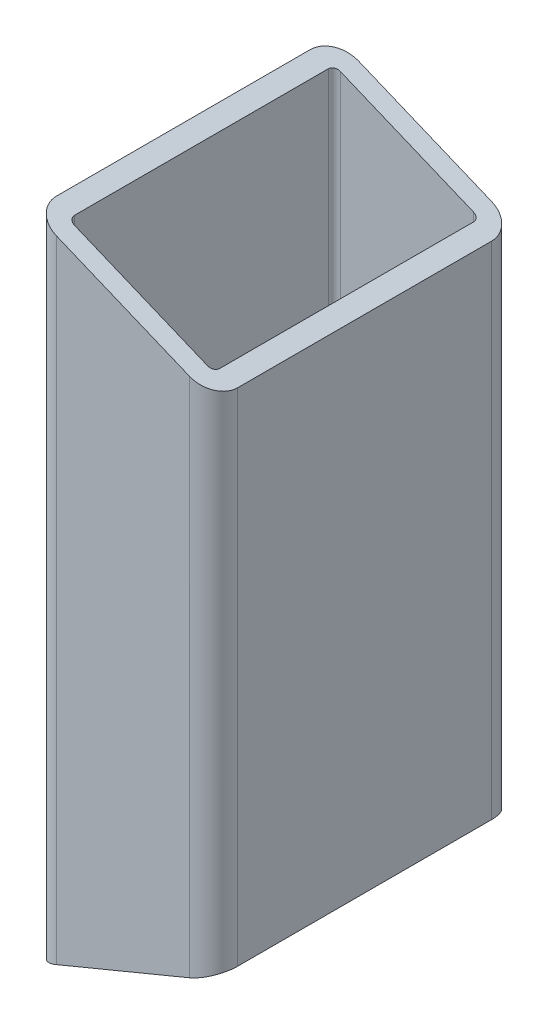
ISO-10303-21;
HEADER;
FILE_DESCRIPTION(('STEP AP214'),'2;1');
FILE_NAME('part.step','',(''),(''),'','','');
FILE_SCHEMA(('AUTOMOTIVE_DESIGN { 1 0 10303 214 1 1 1 1 }'));
ENDSEC;
DATA;
#1=APPLICATION_CONTEXT('core data for automotive mechanical design processes');
#2=APPLICATION_PROTOCOL_DEFINITION('international standard','automotive_design',2000,#1);
#3=PRODUCT_CONTEXT('',#1,'mechanical');
#4=PRODUCT('Part','Part','',(#3));
#5=PRODUCT_RELATED_PRODUCT_CATEGORY('part','',(#4));
#6=PRODUCT_DEFINITION_FORMATION('','',#4);
#7=PRODUCT_DEFINITION_CONTEXT('part definition',#1,'design');
#8=PRODUCT_DEFINITION('design','',#6,#7);
#9=PRODUCT_DEFINITION_SHAPE('','',#8);
#10=(LENGTH_UNIT() NAMED_UNIT(*) SI_UNIT(.MILLI.,.METRE.));
#11=(NAMED_UNIT(*) PLANE_ANGLE_UNIT() SI_UNIT($,.RADIAN.));
#12=(NAMED_UNIT(*) SI_UNIT($,.STERADIAN.) SOLID_ANGLE_UNIT());
#13=UNCERTAINTY_MEASURE_WITH_UNIT(LENGTH_MEASURE(1.E-05),#10,'distance_accuracy_value','');
#14=(GEOMETRIC_REPRESENTATION_CONTEXT(3) GLOBAL_UNCERTAINTY_ASSIGNED_CONTEXT((#13)) GLOBAL_UNIT_ASSIGNED_CONTEXT((#10,
#11,#12)) REPRESENTATION_CONTEXT('',''));
#15=CARTESIAN_POINT('',(0.,0.,0.));
#16=DIRECTION('',(0.,0.,1.));
#17=DIRECTION('',(1.,0.,0.));
#18=AXIS2_PLACEMENT_3D('',#15,#16,#17);
#19=CARTESIAN_POINT('',(0.,0.,22.));
#20=DIRECTION('',(0.,0.,1.));
#21=DIRECTION('',(1.,0.,0.));
#22=AXIS2_PLACEMENT_3D('',#19,#20,#21);
#23=PLANE('',#22);
#24=DIRECTION('',(-0.923879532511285,0.382683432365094,0.));
#25=VECTOR('',#24,1.);
#26=CARTESIAN_POINT('',(15.,41.42359312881,22.));
#27=LINE('',#26,#25);
#28=CARTESIAN_POINT('',(11.,43.0804473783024,22.));
#29=VERTEX_POINT('',#28);
#30=CARTESIAN_POINT('',(-11.,52.1931457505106,22.));
#31=VERTEX_POINT('',#30);
#32=EDGE_CURVE('E197',#29,#31,#27,.T.);
#33=ORIENTED_EDGE('',*,*,#32,.F.);
#34=DIRECTION('',(0.,1.,0.));
#35=VECTOR('',#34,1.);
#36=CARTESIAN_POINT('',(11.,-42.6662338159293,22.));
#37=LINE('',#36,#35);
#38=CARTESIAN_POINT('',(11.,-43.0804473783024,22.));
#39=VERTEX_POINT('',#38);
#40=EDGE_CURVE('E222',#29,#39,#37,.F.);
#41=ORIENTED_EDGE('',*,*,#40,.T.);
#42=DIRECTION('',(0.923879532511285,0.382683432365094,0.));
#43=VECTOR('',#42,1.);
#44=CARTESIAN_POINT('',(-15.,-53.850000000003,22.));
#45=LINE('',#44,#43);
#46=CARTESIAN_POINT('',(-11.,-52.1931457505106,22.));
#47=VERTEX_POINT('',#46);
#48=EDGE_CURVE('E205',#47,#39,#45,.T.);
#49=ORIENTED_EDGE('',*,*,#48,.F.);
#50=DIRECTION('',(0.,-1.,0.));
#51=VECTOR('',#50,1.);
#52=CARTESIAN_POINT('',(-11.,52.6073593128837,22.));
#53=LINE('',#52,#51);
#54=EDGE_CURVE('E220',#47,#31,#53,.F.);
#55=ORIENTED_EDGE('',*,*,#54,.T.);
#56=EDGE_LOOP('',(#33,#41,#49,#55));
#57=FACE_BOUND('',#56,.T.);
#58=ADVANCED_FACE('F35',(#57),#23,.F.);
#59=CARTESIAN_POINT('',(-15.,53.850000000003,22.));
#60=DIRECTION('',(-1.,0.,0.));
#61=DIRECTION('',(0.,0.,1.));
#62=AXIS2_PLACEMENT_3D('',#59,#60,#61);
#63=PLANE('',#62);
#64=DIRECTION('',(0.,0.,1.));
#65=VECTOR('',#64,1.);
#66=CARTESIAN_POINT('',(-15.,-53.850000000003,22.));
#67=LINE('',#66,#65);
#68=CARTESIAN_POINT('',(-15.,-53.850000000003,-21.));
#69=VERTEX_POINT('',#68);
#70=CARTESIAN_POINT('',(-15.,-53.850000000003,21.));
#71=VERTEX_POINT('',#70);
#72=EDGE_CURVE('E193',#69,#71,#67,.T.);
#73=ORIENTED_EDGE('',*,*,#72,.T.);
#74=DIRECTION('',(0.,-1.,0.));
#75=VECTOR('',#74,1.);
#76=CARTESIAN_POINT('',(-15.,53.850000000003,21.));
#77=LINE('',#76,#75);
#78=CARTESIAN_POINT('',(-15.,53.850000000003,21.));
#79=VERTEX_POINT('',#78);
#80=EDGE_CURVE('E267',#71,#79,#77,.F.);
#81=ORIENTED_EDGE('',*,*,#80,.T.);
#82=DIRECTION('',(0.,0.,1.));
#83=VECTOR('',#82,1.);
#84=CARTESIAN_POINT('',(-15.,53.850000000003,22.));
#85=LINE('',#84,#83);
#86=CARTESIAN_POINT('',(-15.,53.850000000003,-21.));
#87=VERTEX_POINT('',#86);
#88=EDGE_CURVE('E175',#87,#79,#85,.T.);
#89=ORIENTED_EDGE('',*,*,#88,.F.);
#90=DIRECTION('',(0.,1.,0.));
#91=VECTOR('',#90,1.);
#92=CARTESIAN_POINT('',(-15.,-53.850000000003,-21.));
#93=LINE('',#92,#91);
#94=EDGE_CURVE('E265',#87,#69,#93,.F.);
#95=ORIENTED_EDGE('',*,*,#94,.T.);
#96=EDGE_LOOP('',(#73,#81,#89,#95));
#97=FACE_BOUND('',#96,.T.);
#98=ADVANCED_FACE('F326',(#97),#63,.T.);
#99=CARTESIAN_POINT('',(15.,41.42359312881,22.));
#100=DIRECTION('',(0.382683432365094,0.923879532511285,0.));
#101=DIRECTION('',(-0.923879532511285,0.382683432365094,0.));
#102=AXIS2_PLACEMENT_3D('',#99,#100,#101);
#103=PLANE('',#102);
#104=DIRECTION('',(-0.923879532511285,0.382683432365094,0.));
#105=VECTOR('',#104,1.);
#106=CARTESIAN_POINT('',(15.,41.42359312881,25.));
#107=LINE('',#106,#105);
#108=CARTESIAN_POINT('',(11.,43.0804473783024,25.));
#109=VERTEX_POINT('',#108);
#110=CARTESIAN_POINT('',(-11.,52.1931457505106,25.));
#111=VERTEX_POINT('',#110);
#112=EDGE_CURVE('E202',#109,#111,#107,.T.);
#113=ORIENTED_EDGE('',*,*,#112,.F.);
#114=CARTESIAN_POINT('',(11.,43.0804473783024,21.));
#115=DIRECTION('',(0.382683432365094,0.923879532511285,0.));
#116=DIRECTION('',(-0.923879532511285,0.382683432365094,0.));
#117=AXIS2_PLACEMENT_3D('',#114,#115,#116);
#118=ELLIPSE('',#117,4.32956880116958,4.);
#119=CARTESIAN_POINT('',(15.,41.42359312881,21.));
#120=VERTEX_POINT('',#119);
#121=EDGE_CURVE('E253',#109,#120,#118,.T.);
#122=ORIENTED_EDGE('',*,*,#121,.T.);
#123=DIRECTION('',(0.,0.,1.));
#124=VECTOR('',#123,1.);
#125=CARTESIAN_POINT('',(15.,41.42359312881,22.));
#126=LINE('',#125,#124);
#127=CARTESIAN_POINT('',(15.,41.42359312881,-21.));
#128=VERTEX_POINT('',#127);
#129=EDGE_CURVE('E180',#128,#120,#126,.T.);
#130=ORIENTED_EDGE('',*,*,#129,.F.);
#131=CARTESIAN_POINT('',(11.,43.0804473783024,-21.));
#132=DIRECTION('',(0.382683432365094,0.923879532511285,0.));
#133=DIRECTION('',(-0.923879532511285,0.382683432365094,0.));
#134=AXIS2_PLACEMENT_3D('',#131,#132,#133);
#135=ELLIPSE('',#134,4.32956880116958,4.);
#136=CARTESIAN_POINT('',(11.,43.0804473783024,-25.));
#137=VERTEX_POINT('',#136);
#138=EDGE_CURVE('E249',#128,#137,#135,.T.);
#139=ORIENTED_EDGE('',*,*,#138,.T.);
#140=DIRECTION('',(0.923879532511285,-0.382683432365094,0.));
#141=VECTOR('',#140,1.);
#142=CARTESIAN_POINT('',(15.,41.42359312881,-25.));
#143=LINE('',#142,#141);
#144=CARTESIAN_POINT('',(-11.,52.1931457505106,-25.));
#145=VERTEX_POINT('',#144);
#146=EDGE_CURVE('E274',#145,#137,#143,.T.);
#147=ORIENTED_EDGE('',*,*,#146,.F.);
#148=CARTESIAN_POINT('',(-11.,52.1931457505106,-21.));
#149=DIRECTION('',(0.382683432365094,0.923879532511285,0.));
#150=DIRECTION('',(0.923879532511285,-0.382683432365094,0.));
#151=AXIS2_PLACEMENT_3D('',#148,#149,#150);
#152=ELLIPSE('',#151,4.32956880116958,4.);
#153=EDGE_CURVE('E247',#145,#87,#152,.T.);
#154=ORIENTED_EDGE('',*,*,#153,.T.);
#155=ORIENTED_EDGE('',*,*,#88,.T.);
#156=CARTESIAN_POINT('',(-11.,52.1931457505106,21.));
#157=DIRECTION('',(0.382683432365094,0.923879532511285,0.));
#158=DIRECTION('',(0.923879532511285,-0.382683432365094,0.));
#159=AXIS2_PLACEMENT_3D('',#156,#157,#158);
#160=ELLIPSE('',#159,4.32956880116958,4.);
#161=EDGE_CURVE('E251',#79,#111,#160,.T.);
#162=ORIENTED_EDGE('',*,*,#161,.T.);
#163=EDGE_LOOP('',(#113,#122,#130,#139,#147,#154,#155,#162));
#164=FACE_BOUND('',#163,.T.);
#165=DIRECTION('',(0.,0.,1.));
#166=VECTOR('',#165,1.);
#167=CARTESIAN_POINT('',(-12.,52.6073593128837,-22.));
#168=LINE('',#167,#166);
#169=CARTESIAN_POINT('',(-12.,52.6073593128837,-21.));
#170=VERTEX_POINT('',#169);
#171=CARTESIAN_POINT('',(-12.,52.6073593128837,21.));
#172=VERTEX_POINT('',#171);
#173=EDGE_CURVE('E156',#170,#172,#168,.T.);
#174=ORIENTED_EDGE('',*,*,#173,.F.);
#175=CARTESIAN_POINT('',(-11.,52.1931457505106,-21.));
#176=DIRECTION('',(0.382683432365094,0.923879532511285,0.));
#177=DIRECTION('',(0.923879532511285,-0.382683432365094,0.));
#178=AXIS2_PLACEMENT_3D('',#175,#176,#177);
#179=ELLIPSE('',#178,1.0823922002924,1.);
#180=CARTESIAN_POINT('',(-11.,52.1931457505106,-22.));
#181=VERTEX_POINT('',#180);
#182=EDGE_CURVE('E151',#170,#181,#179,.F.);
#183=ORIENTED_EDGE('',*,*,#182,.T.);
#184=DIRECTION('',(0.923879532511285,-0.382683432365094,0.));
#185=VECTOR('',#184,1.);
#186=CARTESIAN_POINT('',(15.,41.42359312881,-22.));
#187=LINE('',#186,#185);
#188=CARTESIAN_POINT('',(11.,43.0804473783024,-22.));
#189=VERTEX_POINT('',#188);
#190=EDGE_CURVE('E154',#181,#189,#187,.T.);
#191=ORIENTED_EDGE('',*,*,#190,.T.);
#192=CARTESIAN_POINT('',(11.,43.0804473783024,-21.));
#193=DIRECTION('',(0.382683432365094,0.923879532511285,0.));
#194=DIRECTION('',(-0.923879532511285,0.382683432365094,0.));
#195=AXIS2_PLACEMENT_3D('',#192,#193,#194);
#196=ELLIPSE('',#195,1.0823922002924,1.);
#197=CARTESIAN_POINT('',(12.,42.6662338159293,-21.));
#198=VERTEX_POINT('',#197);
#199=EDGE_CURVE('E229',#189,#198,#196,.F.);
#200=ORIENTED_EDGE('',*,*,#199,.T.);
#201=DIRECTION('',(0.,0.,1.));
#202=VECTOR('',#201,1.);
#203=CARTESIAN_POINT('',(12.,42.6662338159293,-22.));
#204=LINE('',#203,#202);
#205=CARTESIAN_POINT('',(12.,42.6662338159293,21.));
#206=VERTEX_POINT('',#205);
#207=EDGE_CURVE('E186',#198,#206,#204,.T.);
#208=ORIENTED_EDGE('',*,*,#207,.T.);
#209=CARTESIAN_POINT('',(11.,43.0804473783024,21.));
#210=DIRECTION('',(0.382683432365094,0.923879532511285,0.));
#211=DIRECTION('',(0.923879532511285,-0.382683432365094,0.));
#212=AXIS2_PLACEMENT_3D('',#209,#210,#211);
#213=ELLIPSE('',#212,1.0823922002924,1.);
#214=EDGE_CURVE('E233',#206,#29,#213,.F.);
#215=ORIENTED_EDGE('',*,*,#214,.T.);
#216=ORIENTED_EDGE('',*,*,#32,.T.);
#217=CARTESIAN_POINT('',(-11.,52.1931457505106,21.));
#218=DIRECTION('',(0.382683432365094,0.923879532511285,0.));
#219=DIRECTION('',(-0.923879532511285,0.382683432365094,0.));
#220=AXIS2_PLACEMENT_3D('',#217,#218,#219);
#221=ELLIPSE('',#220,1.0823922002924,1.);
#222=EDGE_CURVE('E239',#31,#172,#221,.F.);
#223=ORIENTED_EDGE('',*,*,#222,.T.);
#224=EDGE_LOOP('',(#174,#183,#191,#200,#208,#215,#216,#223));
#225=FACE_BOUND('',#224,.T.);
#226=ADVANCED_FACE('F153',(#164,#225),#103,.T.);
#227=CARTESIAN_POINT('',(15.,-41.42359312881,22.));
#228=DIRECTION('',(1.,0.,0.));
#229=DIRECTION('',(0.,0.,-1.));
#230=AXIS2_PLACEMENT_3D('',#227,#228,#229);
#231=PLANE('',#230);
#232=ORIENTED_EDGE('',*,*,#129,.T.);
#233=DIRECTION('',(0.,1.,0.));
#234=VECTOR('',#233,1.);
#235=CARTESIAN_POINT('',(15.,-41.42359312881,21.));
#236=LINE('',#235,#234);
#237=CARTESIAN_POINT('',(15.,-41.42359312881,21.));
#238=VERTEX_POINT('',#237);
#239=EDGE_CURVE('E257',#120,#238,#236,.F.);
#240=ORIENTED_EDGE('',*,*,#239,.T.);
#241=DIRECTION('',(0.,0.,1.));
#242=VECTOR('',#241,1.);
#243=CARTESIAN_POINT('',(15.,-41.42359312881,22.));
#244=LINE('',#243,#242);
#245=CARTESIAN_POINT('',(15.,-41.42359312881,-21.));
#246=VERTEX_POINT('',#245);
#247=EDGE_CURVE('E196',#246,#238,#244,.T.);
#248=ORIENTED_EDGE('',*,*,#247,.F.);
#249=DIRECTION('',(0.,-1.,0.));
#250=VECTOR('',#249,1.);
#251=CARTESIAN_POINT('',(15.,41.42359312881,-21.));
#252=LINE('',#251,#250);
#253=EDGE_CURVE('E255',#246,#128,#252,.F.);
#254=ORIENTED_EDGE('',*,*,#253,.T.);
#255=EDGE_LOOP('',(#232,#240,#248,#254));
#256=FACE_BOUND('',#255,.T.);
#257=ADVANCED_FACE('F341',(#256),#231,.T.);
#258=CARTESIAN_POINT('',(-15.,-53.850000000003,22.));
#259=DIRECTION('',(0.382683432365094,-0.923879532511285,0.));
#260=DIRECTION('',(0.923879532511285,0.382683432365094,0.));
#261=AXIS2_PLACEMENT_3D('',#258,#259,#260);
#262=PLANE('',#261);
#263=DIRECTION('',(0.,0.,1.));
#264=VECTOR('',#263,1.);
#265=CARTESIAN_POINT('',(12.,-42.6662338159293,-22.));
#266=LINE('',#265,#264);
#267=CARTESIAN_POINT('',(12.,-42.6662338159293,-21.));
#268=VERTEX_POINT('',#267);
#269=CARTESIAN_POINT('',(12.,-42.6662338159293,21.));
#270=VERTEX_POINT('',#269);
#271=EDGE_CURVE('E189',#268,#270,#266,.T.);
#272=ORIENTED_EDGE('',*,*,#271,.F.);
#273=CARTESIAN_POINT('',(11.,-43.0804473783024,-21.));
#274=DIRECTION('',(0.382683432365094,-0.923879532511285,0.));
#275=DIRECTION('',(0.923879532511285,0.382683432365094,0.));
#276=AXIS2_PLACEMENT_3D('',#273,#274,#275);
#277=ELLIPSE('',#276,1.0823922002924,1.);
#278=CARTESIAN_POINT('',(11.,-43.0804473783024,-22.));
#279=VERTEX_POINT('',#278);
#280=EDGE_CURVE('E231',#268,#279,#277,.F.);
#281=ORIENTED_EDGE('',*,*,#280,.T.);
#282=DIRECTION('',(-0.923879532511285,-0.382683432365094,0.));
#283=VECTOR('',#282,1.);
#284=CARTESIAN_POINT('',(-15.,-53.850000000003,-22.));
#285=LINE('',#284,#283);
#286=CARTESIAN_POINT('',(-11.,-52.1931457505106,-22.));
#287=VERTEX_POINT('',#286);
#288=EDGE_CURVE('E172',#279,#287,#285,.T.);
#289=ORIENTED_EDGE('',*,*,#288,.T.);
#290=CARTESIAN_POINT('',(-11.,-52.1931457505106,-21.));
#291=DIRECTION('',(0.382683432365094,-0.923879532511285,0.));
#292=DIRECTION('',(-0.923879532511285,-0.382683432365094,0.));
#293=AXIS2_PLACEMENT_3D('',#290,#291,#292);
#294=ELLIPSE('',#293,1.0823922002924,1.);
#295=CARTESIAN_POINT('',(-12.,-52.6073593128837,-21.));
#296=VERTEX_POINT('',#295);
#297=EDGE_CURVE('E161',#287,#296,#294,.F.);
#298=ORIENTED_EDGE('',*,*,#297,.T.);
#299=DIRECTION('',(0.,0.,1.));
#300=VECTOR('',#299,1.);
#301=CARTESIAN_POINT('',(-12.,-52.6073593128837,-22.));
#302=LINE('',#301,#300);
#303=CARTESIAN_POINT('',(-12.,-52.6073593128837,21.));
#304=VERTEX_POINT('',#303);
#305=EDGE_CURVE('E283',#296,#304,#302,.T.);
#306=ORIENTED_EDGE('',*,*,#305,.T.);
#307=CARTESIAN_POINT('',(-11.,-52.1931457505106,21.));
#308=DIRECTION('',(0.382683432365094,-0.923879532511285,0.));
#309=DIRECTION('',(0.923879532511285,0.382683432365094,0.));
#310=AXIS2_PLACEMENT_3D('',#307,#308,#309);
#311=ELLIPSE('',#310,1.0823922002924,1.);
#312=EDGE_CURVE('E160',#304,#47,#311,.F.);
#313=ORIENTED_EDGE('',*,*,#312,.T.);
#314=ORIENTED_EDGE('',*,*,#48,.T.);
#315=CARTESIAN_POINT('',(11.,-43.0804473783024,21.));
#316=DIRECTION('',(0.382683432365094,-0.923879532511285,0.));
#317=DIRECTION('',(-0.923879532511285,-0.382683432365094,0.));
#318=AXIS2_PLACEMENT_3D('',#315,#316,#317);
#319=ELLIPSE('',#318,1.0823922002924,1.);
#320=EDGE_CURVE('E235',#39,#270,#319,.F.);
#321=ORIENTED_EDGE('',*,*,#320,.T.);
#322=EDGE_LOOP('',(#272,#281,#289,#298,#306,#313,#314,#321));
#323=FACE_BOUND('',#322,.T.);
#324=ORIENTED_EDGE('',*,*,#247,.T.);
#325=CARTESIAN_POINT('',(11.,-43.0804473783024,21.));
#326=DIRECTION('',(0.382683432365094,-0.923879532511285,0.));
#327=DIRECTION('',(0.923879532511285,0.382683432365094,0.));
#328=AXIS2_PLACEMENT_3D('',#325,#326,#327);
#329=ELLIPSE('',#328,4.32956880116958,4.);
#330=CARTESIAN_POINT('',(11.,-43.0804473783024,25.));
#331=VERTEX_POINT('',#330);
#332=EDGE_CURVE('E263',#238,#331,#329,.T.);
#333=ORIENTED_EDGE('',*,*,#332,.T.);
#334=DIRECTION('',(0.923879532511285,0.382683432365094,0.));
#335=VECTOR('',#334,1.);
#336=CARTESIAN_POINT('',(-15.,-53.850000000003,25.));
#337=LINE('',#336,#335);
#338=CARTESIAN_POINT('',(-11.,-52.1931457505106,25.));
#339=VERTEX_POINT('',#338);
#340=EDGE_CURVE('E206',#339,#331,#337,.T.);
#341=ORIENTED_EDGE('',*,*,#340,.F.);
#342=CARTESIAN_POINT('',(-11.,-52.1931457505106,21.));
#343=DIRECTION('',(0.382683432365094,-0.923879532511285,0.));
#344=DIRECTION('',(-0.923879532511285,-0.382683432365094,0.));
#345=AXIS2_PLACEMENT_3D('',#342,#343,#344);
#346=ELLIPSE('',#345,4.32956880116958,4.);
#347=EDGE_CURVE('E261',#339,#71,#346,.T.);
#348=ORIENTED_EDGE('',*,*,#347,.T.);
#349=ORIENTED_EDGE('',*,*,#72,.F.);
#350=CARTESIAN_POINT('',(-11.,-52.1931457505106,-21.));
#351=DIRECTION('',(0.382683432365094,-0.923879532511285,0.));
#352=DIRECTION('',(-0.923879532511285,-0.382683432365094,0.));
#353=AXIS2_PLACEMENT_3D('',#350,#351,#352);
#354=ELLIPSE('',#353,4.32956880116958,4.);
#355=CARTESIAN_POINT('',(-11.,-52.1931457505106,-25.));
#356=VERTEX_POINT('',#355);
#357=EDGE_CURVE('E50',#69,#356,#354,.T.);
#358=ORIENTED_EDGE('',*,*,#357,.T.);
#359=DIRECTION('',(-0.923879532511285,-0.382683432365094,0.));
#360=VECTOR('',#359,1.);
#361=CARTESIAN_POINT('',(-15.,-53.850000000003,-25.));
#362=LINE('',#361,#360);
#363=CARTESIAN_POINT('',(11.,-43.0804473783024,-25.));
#364=VERTEX_POINT('',#363);
#365=EDGE_CURVE('E275',#364,#356,#362,.T.);
#366=ORIENTED_EDGE('',*,*,#365,.F.);
#367=CARTESIAN_POINT('',(11.,-43.0804473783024,-21.));
#368=DIRECTION('',(0.382683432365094,-0.923879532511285,0.));
#369=DIRECTION('',(0.923879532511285,0.382683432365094,0.));
#370=AXIS2_PLACEMENT_3D('',#367,#368,#369);
#371=ELLIPSE('',#370,4.32956880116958,4.);
#372=EDGE_CURVE('E58',#364,#246,#371,.T.);
#373=ORIENTED_EDGE('',*,*,#372,.T.);
#374=EDGE_LOOP('',(#324,#333,#341,#348,#349,#358,#366,#373));
#375=FACE_BOUND('',#374,.T.);
#376=ADVANCED_FACE('F299',(#323,#375),#262,.T.);
#377=CARTESIAN_POINT('',(0.,0.,25.));
#378=DIRECTION('',(0.,0.,1.));
#379=DIRECTION('',(1.,0.,0.));
#380=AXIS2_PLACEMENT_3D('',#377,#378,#379);
#381=PLANE('',#380);
#382=ORIENTED_EDGE('',*,*,#340,.T.);
#383=DIRECTION('',(0.,1.,0.));
#384=VECTOR('',#383,1.);
#385=CARTESIAN_POINT('',(11.,0.,25.));
#386=LINE('',#385,#384);
#387=EDGE_CURVE('E244',#331,#109,#386,.T.);
#388=ORIENTED_EDGE('',*,*,#387,.T.);
#389=ORIENTED_EDGE('',*,*,#112,.T.);
#390=DIRECTION('',(0.,-1.,0.));
#391=VECTOR('',#390,1.);
#392=CARTESIAN_POINT('',(-11.,0.,25.));
#393=LINE('',#392,#391);
#394=EDGE_CURVE('E241',#111,#339,#393,.T.);
#395=ORIENTED_EDGE('',*,*,#394,.T.);
#396=EDGE_LOOP('',(#382,#388,#389,#395));
#397=FACE_BOUND('',#396,.T.);
#398=ADVANCED_FACE('F335',(#397),#381,.T.);
#399=CARTESIAN_POINT('',(12.,42.6662338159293,-22.));
#400=DIRECTION('',(1.,0.,0.));
#401=DIRECTION('',(0.,0.,-1.));
#402=AXIS2_PLACEMENT_3D('',#399,#400,#401);
#403=PLANE('',#402);
#404=ORIENTED_EDGE('',*,*,#207,.F.);
#405=DIRECTION('',(0.,1.,0.));
#406=VECTOR('',#405,1.);
#407=CARTESIAN_POINT('',(12.,42.6662338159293,-21.));
#408=LINE('',#407,#406);
#409=EDGE_CURVE('E217',#198,#268,#408,.F.);
#410=ORIENTED_EDGE('',*,*,#409,.T.);
#411=ORIENTED_EDGE('',*,*,#271,.T.);
#412=DIRECTION('',(0.,1.,0.));
#413=VECTOR('',#412,1.);
#414=CARTESIAN_POINT('',(12.,42.6662338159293,21.));
#415=LINE('',#414,#413);
#416=EDGE_CURVE('E177',#270,#206,#415,.T.);
#417=ORIENTED_EDGE('',*,*,#416,.T.);
#418=EDGE_LOOP('',(#404,#410,#411,#417));
#419=FACE_BOUND('',#418,.T.);
#420=ADVANCED_FACE('F312',(#419),#403,.F.);
#421=CARTESIAN_POINT('',(-12.,-52.6073593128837,-22.));
#422=DIRECTION('',(-1.,0.,0.));
#423=DIRECTION('',(0.,0.,1.));
#424=AXIS2_PLACEMENT_3D('',#421,#422,#423);
#425=PLANE('',#424);
#426=ORIENTED_EDGE('',*,*,#305,.F.);
#427=DIRECTION('',(0.,-1.,0.));
#428=VECTOR('',#427,1.);
#429=CARTESIAN_POINT('',(-12.,-52.6073593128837,-21.));
#430=LINE('',#429,#428);
#431=EDGE_CURVE('E227',#296,#170,#430,.F.);
#432=ORIENTED_EDGE('',*,*,#431,.T.);
#433=ORIENTED_EDGE('',*,*,#173,.T.);
#434=DIRECTION('',(0.,-1.,0.));
#435=VECTOR('',#434,1.);
#436=CARTESIAN_POINT('',(-12.,-52.6073593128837,21.));
#437=LINE('',#436,#435);
#438=EDGE_CURVE('E224',#172,#304,#437,.T.);
#439=ORIENTED_EDGE('',*,*,#438,.T.);
#440=EDGE_LOOP('',(#426,#432,#433,#439));
#441=FACE_BOUND('',#440,.T.);
#442=ADVANCED_FACE('F291',(#441),#425,.F.);
#443=CARTESIAN_POINT('',(0.,0.,-22.));
#444=DIRECTION('',(0.,0.,1.));
#445=DIRECTION('',(1.,0.,0.));
#446=AXIS2_PLACEMENT_3D('',#443,#444,#445);
#447=PLANE('',#446);
#448=ORIENTED_EDGE('',*,*,#288,.F.);
#449=DIRECTION('',(0.,1.,0.));
#450=VECTOR('',#449,1.);
#451=CARTESIAN_POINT('',(11.,0.,-22.));
#452=LINE('',#451,#450);
#453=EDGE_CURVE('E171',#279,#189,#452,.T.);
#454=ORIENTED_EDGE('',*,*,#453,.T.);
#455=ORIENTED_EDGE('',*,*,#190,.F.);
#456=DIRECTION('',(0.,-1.,0.));
#457=VECTOR('',#456,1.);
#458=CARTESIAN_POINT('',(-11.,0.,-22.));
#459=LINE('',#458,#457);
#460=EDGE_CURVE('E168',#181,#287,#459,.T.);
#461=ORIENTED_EDGE('',*,*,#460,.T.);
#462=EDGE_LOOP('',(#448,#454,#455,#461));
#463=FACE_BOUND('',#462,.T.);
#464=ADVANCED_FACE('F167',(#463),#447,.T.);
#465=CARTESIAN_POINT('',(0.,0.,-25.));
#466=DIRECTION('',(0.,0.,1.));
#467=DIRECTION('',(1.,0.,0.));
#468=AXIS2_PLACEMENT_3D('',#465,#466,#467);
#469=PLANE('',#468);
#470=ORIENTED_EDGE('',*,*,#146,.T.);
#471=DIRECTION('',(0.,-1.,0.));
#472=VECTOR('',#471,1.);
#473=CARTESIAN_POINT('',(11.,-41.42359312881,-25.));
#474=LINE('',#473,#472);
#475=EDGE_CURVE('E11',#137,#364,#474,.T.);
#476=ORIENTED_EDGE('',*,*,#475,.T.);
#477=ORIENTED_EDGE('',*,*,#365,.T.);
#478=DIRECTION('',(0.,1.,0.));
#479=VECTOR('',#478,1.);
#480=CARTESIAN_POINT('',(-11.,53.850000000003,-25.));
#481=LINE('',#480,#479);
#482=EDGE_CURVE('E43',#356,#145,#481,.T.);
#483=ORIENTED_EDGE('',*,*,#482,.T.);
#484=EDGE_LOOP('',(#470,#476,#477,#483));
#485=FACE_BOUND('',#484,.T.);
#486=ADVANCED_FACE('F273',(#485),#469,.F.);
#487=CARTESIAN_POINT('',(11.,0.,-21.));
#488=DIRECTION('',(0.,1.,0.));
#489=DIRECTION('',(0.,0.,1.));
#490=AXIS2_PLACEMENT_3D('',#487,#488,#489);
#491=CYLINDRICAL_SURFACE('',#490,1.);
#492=ORIENTED_EDGE('',*,*,#280,.F.);
#493=ORIENTED_EDGE('',*,*,#409,.F.);
#494=ORIENTED_EDGE('',*,*,#199,.F.);
#495=ORIENTED_EDGE('',*,*,#453,.F.);
#496=EDGE_LOOP('',(#492,#493,#494,#495));
#497=FACE_BOUND('',#496,.T.);
#498=ADVANCED_FACE('F315',(#497),#491,.F.);
#499=CARTESIAN_POINT('',(11.,42.6662338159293,21.));
#500=DIRECTION('',(0.,-1.,0.));
#501=DIRECTION('',(0.,0.,-1.));
#502=AXIS2_PLACEMENT_3D('',#499,#500,#501);
#503=CYLINDRICAL_SURFACE('',#502,1.);
#504=ORIENTED_EDGE('',*,*,#320,.F.);
#505=ORIENTED_EDGE('',*,*,#40,.F.);
#506=ORIENTED_EDGE('',*,*,#214,.F.);
#507=ORIENTED_EDGE('',*,*,#416,.F.);
#508=EDGE_LOOP('',(#504,#505,#506,#507));
#509=FACE_BOUND('',#508,.T.);
#510=ADVANCED_FACE('F305',(#509),#503,.F.);
#511=CARTESIAN_POINT('',(-11.,0.,-21.));
#512=DIRECTION('',(0.,-1.,0.));
#513=DIRECTION('',(0.,0.,-1.));
#514=AXIS2_PLACEMENT_3D('',#511,#512,#513);
#515=CYLINDRICAL_SURFACE('',#514,1.);
#516=ORIENTED_EDGE('',*,*,#182,.F.);
#517=ORIENTED_EDGE('',*,*,#431,.F.);
#518=ORIENTED_EDGE('',*,*,#297,.F.);
#519=ORIENTED_EDGE('',*,*,#460,.F.);
#520=EDGE_LOOP('',(#516,#517,#518,#519));
#521=FACE_BOUND('',#520,.T.);
#522=ADVANCED_FACE('F174',(#521),#515,.F.);
#523=CARTESIAN_POINT('',(-11.,-52.6073593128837,21.));
#524=DIRECTION('',(0.,1.,0.));
#525=DIRECTION('',(0.,0.,1.));
#526=AXIS2_PLACEMENT_3D('',#523,#524,#525);
#527=CYLINDRICAL_SURFACE('',#526,1.);
#528=ORIENTED_EDGE('',*,*,#222,.F.);
#529=ORIENTED_EDGE('',*,*,#54,.F.);
#530=ORIENTED_EDGE('',*,*,#312,.F.);
#531=ORIENTED_EDGE('',*,*,#438,.F.);
#532=EDGE_LOOP('',(#528,#529,#530,#531));
#533=FACE_BOUND('',#532,.T.);
#534=ADVANCED_FACE('F294',(#533),#527,.F.);
#535=CARTESIAN_POINT('',(11.,0.,21.));
#536=DIRECTION('',(0.,1.,0.));
#537=DIRECTION('',(0.,0.,1.));
#538=AXIS2_PLACEMENT_3D('',#535,#536,#537);
#539=CYLINDRICAL_SURFACE('',#538,4.);
#540=ORIENTED_EDGE('',*,*,#332,.F.);
#541=ORIENTED_EDGE('',*,*,#239,.F.);
#542=ORIENTED_EDGE('',*,*,#121,.F.);
#543=ORIENTED_EDGE('',*,*,#387,.F.);
#544=EDGE_LOOP('',(#540,#541,#542,#543));
#545=FACE_BOUND('',#544,.T.);
#546=ADVANCED_FACE('F380',(#545),#539,.T.);
#547=CARTESIAN_POINT('',(-11.,0.,21.));
#548=DIRECTION('',(0.,-1.,0.));
#549=DIRECTION('',(0.,0.,-1.));
#550=AXIS2_PLACEMENT_3D('',#547,#548,#549);
#551=CYLINDRICAL_SURFACE('',#550,4.);
#552=ORIENTED_EDGE('',*,*,#161,.F.);
#553=ORIENTED_EDGE('',*,*,#80,.F.);
#554=ORIENTED_EDGE('',*,*,#347,.F.);
#555=ORIENTED_EDGE('',*,*,#394,.F.);
#556=EDGE_LOOP('',(#552,#553,#554,#555));
#557=FACE_BOUND('',#556,.T.);
#558=ADVANCED_FACE('F385',(#557),#551,.T.);
#559=CARTESIAN_POINT('',(11.,0.,-21.));
#560=DIRECTION('',(0.,1.,0.));
#561=DIRECTION('',(0.,0.,1.));
#562=AXIS2_PLACEMENT_3D('',#559,#560,#561);
#563=CYLINDRICAL_SURFACE('',#562,4.);
#564=ORIENTED_EDGE('',*,*,#138,.F.);
#565=ORIENTED_EDGE('',*,*,#253,.F.);
#566=ORIENTED_EDGE('',*,*,#372,.F.);
#567=ORIENTED_EDGE('',*,*,#475,.F.);
#568=EDGE_LOOP('',(#564,#565,#566,#567));
#569=FACE_BOUND('',#568,.T.);
#570=ADVANCED_FACE('F397',(#569),#563,.T.);
#571=CARTESIAN_POINT('',(-11.,0.,-21.));
#572=DIRECTION('',(0.,-1.,0.));
#573=DIRECTION('',(0.,0.,-1.));
#574=AXIS2_PLACEMENT_3D('',#571,#572,#573);
#575=CYLINDRICAL_SURFACE('',#574,4.);
#576=ORIENTED_EDGE('',*,*,#357,.F.);
#577=ORIENTED_EDGE('',*,*,#94,.F.);
#578=ORIENTED_EDGE('',*,*,#153,.F.);
#579=ORIENTED_EDGE('',*,*,#482,.F.);
#580=EDGE_LOOP('',(#576,#577,#578,#579));
#581=FACE_BOUND('',#580,.T.);
#582=ADVANCED_FACE('F37',(#581),#575,.T.);
#583=CLOSED_SHELL('',(#58,#98,#226,#257,#376,#398,#420,#442,#464,#486,#498,#510,#522,#534,#546,
#558,#570,#582));
#584=MANIFOLD_SOLID_BREP('B2',#583);
#585=ADVANCED_BREP_SHAPE_REPRESENTATION('',(#18,#584),#14);
#586=SHAPE_DEFINITION_REPRESENTATION(#9,#585);
ENDSEC;
END-ISO-10303-21;
